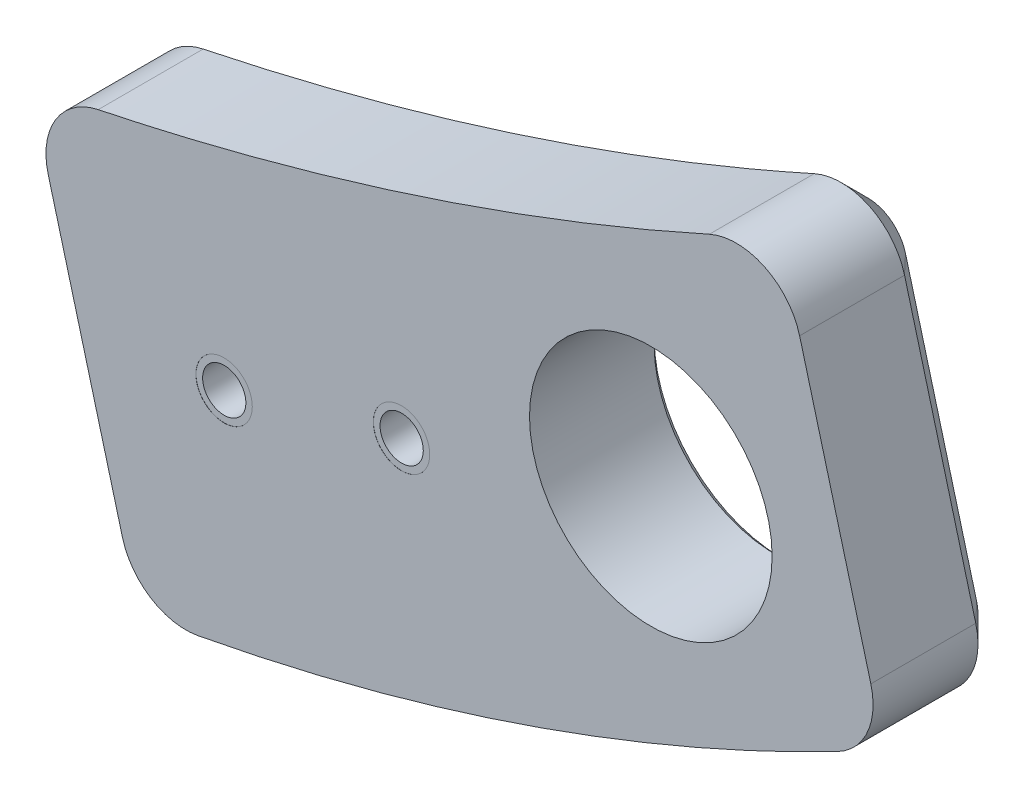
ISO-10303-21;
HEADER;
FILE_DESCRIPTION(('STEP AP214'),'2;1');
FILE_NAME('part.step','',(''),(''),'','','');
FILE_SCHEMA(('AUTOMOTIVE_DESIGN { 1 0 10303 214 1 1 1 1 }'));
ENDSEC;
DATA;
#1=APPLICATION_CONTEXT('core data for automotive mechanical design processes');
#2=APPLICATION_PROTOCOL_DEFINITION('international standard','automotive_design',2000,#1);
#3=PRODUCT_CONTEXT('',#1,'mechanical');
#4=PRODUCT('Part','Part','',(#3));
#5=PRODUCT_RELATED_PRODUCT_CATEGORY('part','',(#4));
#6=PRODUCT_DEFINITION_FORMATION('','',#4);
#7=PRODUCT_DEFINITION_CONTEXT('part definition',#1,'design');
#8=PRODUCT_DEFINITION('design','',#6,#7);
#9=PRODUCT_DEFINITION_SHAPE('','',#8);
#10=(LENGTH_UNIT() NAMED_UNIT(*) SI_UNIT(.MILLI.,.METRE.));
#11=(NAMED_UNIT(*) PLANE_ANGLE_UNIT() SI_UNIT($,.RADIAN.));
#12=(NAMED_UNIT(*) SI_UNIT($,.STERADIAN.) SOLID_ANGLE_UNIT());
#13=UNCERTAINTY_MEASURE_WITH_UNIT(LENGTH_MEASURE(1.E-05),#10,'distance_accuracy_value','');
#14=(GEOMETRIC_REPRESENTATION_CONTEXT(3) GLOBAL_UNCERTAINTY_ASSIGNED_CONTEXT((#13)) GLOBAL_UNIT_ASSIGNED_CONTEXT((#10,
#11,#12)) REPRESENTATION_CONTEXT('',''));
#15=CARTESIAN_POINT('',(0.,0.,0.));
#16=DIRECTION('',(0.,0.,1.));
#17=DIRECTION('',(1.,0.,0.));
#18=AXIS2_PLACEMENT_3D('',#15,#16,#17);
#19=CARTESIAN_POINT('',(58.91880680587,-209.017886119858,-10.));
#20=DIRECTION('',(0.,0.,-1.));
#21=DIRECTION('',(1.,0.,0.));
#22=AXIS2_PLACEMENT_3D('',#19,#20,#21);
#23=CYLINDRICAL_SURFACE('',#22,2.15);
#24=CARTESIAN_POINT('',(58.91880680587,-209.017886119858,0.));
#25=DIRECTION('',(0.,0.,1.));
#26=DIRECTION('',(1.,0.,0.));
#27=AXIS2_PLACEMENT_3D('',#24,#25,#26);
#28=CIRCLE('',#27,2.15);
#29=CARTESIAN_POINT('',(61.06880680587,-209.017886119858,0.));
#30=VERTEX_POINT('',#29);
#31=EDGE_CURVE('E157',#30,#30,#28,.T.);
#32=ORIENTED_EDGE('',*,*,#31,.T.);
#33=EDGE_LOOP('',(#32));
#34=FACE_BOUND('',#33,.T.);
#35=CARTESIAN_POINT('',(58.91880680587,-209.017886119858,-0.00999999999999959));
#36=DIRECTION('',(0.,0.,-1.));
#37=DIRECTION('',(-1.,0.,0.));
#38=AXIS2_PLACEMENT_3D('',#35,#36,#37);
#39=CIRCLE('',#38,2.15);
#40=CARTESIAN_POINT('',(56.76880680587,-209.017886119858,-0.00999999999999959));
#41=VERTEX_POINT('',#40);
#42=EDGE_CURVE('E12',#41,#41,#39,.F.);
#43=ORIENTED_EDGE('',*,*,#42,.F.);
#44=EDGE_LOOP('',(#43));
#45=FACE_BOUND('',#44,.T.);
#46=ADVANCED_FACE('F36',(#34,#45),#23,.F.);
#47=CARTESIAN_POINT('',(72.4467445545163,-205.413042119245,-10.));
#48=DIRECTION('',(0.,0.,-1.));
#49=DIRECTION('',(1.,0.,0.));
#50=AXIS2_PLACEMENT_3D('',#47,#48,#49);
#51=CYLINDRICAL_SURFACE('',#50,2.15);
#52=CARTESIAN_POINT('',(72.4467445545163,-205.413042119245,0.));
#53=DIRECTION('',(0.,0.,1.));
#54=DIRECTION('',(1.,0.,0.));
#55=AXIS2_PLACEMENT_3D('',#52,#53,#54);
#56=CIRCLE('',#55,2.15);
#57=CARTESIAN_POINT('',(74.5967445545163,-205.413042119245,0.));
#58=VERTEX_POINT('',#57);
#59=EDGE_CURVE('E152',#58,#58,#56,.T.);
#60=ORIENTED_EDGE('',*,*,#59,.T.);
#61=EDGE_LOOP('',(#60));
#62=FACE_BOUND('',#61,.T.);
#63=CARTESIAN_POINT('',(72.4467445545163,-205.413042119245,-0.00999999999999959));
#64=DIRECTION('',(0.,0.,-1.));
#65=DIRECTION('',(-1.,0.,0.));
#66=AXIS2_PLACEMENT_3D('',#63,#64,#65);
#67=CIRCLE('',#66,2.15);
#68=CARTESIAN_POINT('',(70.2967445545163,-205.413042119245,-0.00999999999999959));
#69=VERTEX_POINT('',#68);
#70=EDGE_CURVE('E44',#69,#69,#67,.F.);
#71=ORIENTED_EDGE('',*,*,#70,.F.);
#72=EDGE_LOOP('',(#71));
#73=FACE_BOUND('',#72,.T.);
#74=ADVANCED_FACE('F169',(#62,#73),#51,.F.);
#75=CARTESIAN_POINT('',(45.7938400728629,-131.897870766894,-4.));
#76=DIRECTION('',(0.,0.,1.));
#77=DIRECTION('',(-0.965925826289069,-0.25881904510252,0.));
#78=AXIS2_PLACEMENT_3D('',#75,#76,#77);
#79=ELLIPSE('',#78,130.28,94.5);
#80=DIRECTION('',(0.,0.,1.));
#81=VECTOR('',#80,1.);
#82=SURFACE_OF_LINEAR_EXTRUSION('',#79,#81);
#83=DIRECTION('',(0.,0.,1.));
#84=VECTOR('',#83,1.);
#85=CARTESIAN_POINT('',(105.704191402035,-209.472004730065,0.));
#86=LINE('',#85,#84);
#87=CARTESIAN_POINT('',(105.704191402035,-209.472004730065,0.));
#88=VERTEX_POINT('',#87);
#89=CARTESIAN_POINT('',(105.704191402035,-209.472004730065,-7.99999999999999));
#90=VERTEX_POINT('',#89);
#91=EDGE_CURVE('E474',#88,#90,#86,.F.);
#92=ORIENTED_EDGE('',*,*,#91,.F.);
#93=CARTESIAN_POINT('',(45.7938400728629,-131.897870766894,0.));
#94=DIRECTION('',(0.,0.,1.));
#95=DIRECTION('',(-0.965925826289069,-0.25881904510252,0.));
#96=AXIS2_PLACEMENT_3D('',#93,#94,#95);
#97=ELLIPSE('',#96,130.28,94.5);
#98=CARTESIAN_POINT('',(56.9191718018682,-226.210883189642,0.));
#99=VERTEX_POINT('',#98);
#100=EDGE_CURVE('E491',#99,#88,#97,.T.);
#101=ORIENTED_EDGE('',*,*,#100,.F.);
#102=DIRECTION('',(0.,0.,1.));
#103=VECTOR('',#102,1.);
#104=CARTESIAN_POINT('',(56.9191718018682,-226.210883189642,-4.));
#105=LINE('',#104,#103);
#106=CARTESIAN_POINT('',(56.9191718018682,-226.210883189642,-7.99999999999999));
#107=VERTEX_POINT('',#106);
#108=EDGE_CURVE('E484',#107,#99,#105,.T.);
#109=ORIENTED_EDGE('',*,*,#108,.F.);
#110=CARTESIAN_POINT('',(105.704191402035,-209.472004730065,-7.99999999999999));
#111=CARTESIAN_POINT('',(90.2570401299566,-217.453363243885,-7.99999999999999));
#112=CARTESIAN_POINT('',(73.9873508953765,-222.986543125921,-7.99999999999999));
#113=CARTESIAN_POINT('',(56.9191718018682,-226.210883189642,-7.99999999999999));
#114=B_SPLINE_CURVE_WITH_KNOTS('',3,(#110,#111,#112,#113),.UNSPECIFIED.,.F.,.F.,(4,4),(0.,
0.0509933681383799),.UNSPECIFIED.);
#115=EDGE_CURVE('E190',#90,#107,#114,.T.);
#116=ORIENTED_EDGE('',*,*,#115,.F.);
#117=EDGE_LOOP('',(#92,#101,#109,#116));
#118=FACE_BOUND('',#117,.T.);
#119=ADVANCED_FACE('F163',(#118),#82,.T.);
#120=CARTESIAN_POINT('',(45.7938400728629,-131.897870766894,-4.));
#121=DIRECTION('',(0.,0.,-1.));
#122=DIRECTION('',(0.965925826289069,0.25881904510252,0.));
#123=AXIS2_PLACEMENT_3D('',#120,#121,#122);
#124=ELLIPSE('',#123,120.,62.5);
#125=DIRECTION('',(0.,0.,1.));
#126=VECTOR('',#125,1.);
#127=SURFACE_OF_LINEAR_EXTRUSION('',#124,#126);
#128=DIRECTION('',(0.,0.,1.));
#129=VECTOR('',#128,1.);
#130=CARTESIAN_POINT('',(49.3187012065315,-195.277391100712,0.));
#131=LINE('',#130,#129);
#132=CARTESIAN_POINT('',(49.3187012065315,-195.277391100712,0.));
#133=VERTEX_POINT('',#132);
#134=CARTESIAN_POINT('',(49.3187012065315,-195.277391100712,-7.99999999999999));
#135=VERTEX_POINT('',#134);
#136=EDGE_CURVE('E412',#133,#135,#131,.F.);
#137=ORIENTED_EDGE('',*,*,#136,.F.);
#138=CARTESIAN_POINT('',(45.7938400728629,-131.897870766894,0.));
#139=DIRECTION('',(0.,0.,-1.));
#140=DIRECTION('',(0.965925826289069,0.25881904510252,0.));
#141=AXIS2_PLACEMENT_3D('',#138,#139,#140);
#142=ELLIPSE('',#141,120.,62.5);
#143=CARTESIAN_POINT('',(95.916568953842,-180.206914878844,0.));
#144=VERTEX_POINT('',#143);
#145=EDGE_CURVE('E461',#144,#133,#142,.T.);
#146=ORIENTED_EDGE('',*,*,#145,.F.);
#147=DIRECTION('',(0.,0.,1.));
#148=VECTOR('',#147,1.);
#149=CARTESIAN_POINT('',(95.916568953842,-180.206914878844,-4.));
#150=LINE('',#149,#148);
#151=CARTESIAN_POINT('',(95.916568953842,-180.206914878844,-7.99999999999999));
#152=VERTEX_POINT('',#151);
#153=EDGE_CURVE('E419',#152,#144,#150,.T.);
#154=ORIENTED_EDGE('',*,*,#153,.F.);
#155=CARTESIAN_POINT('',(49.3187012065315,-195.277391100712,-7.99999999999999));
#156=CARTESIAN_POINT('',(65.3912848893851,-191.917628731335,-7.99999999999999));
#157=CARTESIAN_POINT('',(80.948310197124,-186.939678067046,-7.99999999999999));
#158=CARTESIAN_POINT('',(95.916568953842,-180.206914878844,-7.99999999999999));
#159=B_SPLINE_CURVE_WITH_KNOTS('',3,(#155,#156,#157,#158),.UNSPECIFIED.,.F.,.F.,(4,4),(0.,
0.049410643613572),.UNSPECIFIED.);
#160=EDGE_CURVE('E448',#135,#152,#159,.T.);
#161=ORIENTED_EDGE('',*,*,#160,.F.);
#162=EDGE_LOOP('',(#137,#146,#154,#161));
#163=FACE_BOUND('',#162,.T.);
#164=ADVANCED_FACE('F168',(#163),#127,.T.);
#165=CARTESIAN_POINT('',(-14.239497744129,-121.423692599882,0.));
#166=DIRECTION('',(0.,0.,-1.));
#167=DIRECTION('',(1.,0.,0.));
#168=AXIS2_PLACEMENT_3D('',#165,#166,#167);
#169=PLANE('',#168);
#170=ORIENTED_EDGE('',*,*,#59,.F.);
#171=EDGE_LOOP('',(#170));
#172=FACE_BOUND('',#171,.T.);
#173=ORIENTED_EDGE('',*,*,#31,.F.);
#174=EDGE_LOOP('',(#173));
#175=FACE_BOUND('',#174,.T.);
#176=CARTESIAN_POINT('',(91.4554272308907,-199.08029427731,0.));
#177=DIRECTION('',(0.,0.,1.));
#178=DIRECTION('',(1.,0.,0.));
#179=AXIS2_PLACEMENT_3D('',#176,#177,#178);
#180=CIRCLE('',#179,9.24999999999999);
#181=CARTESIAN_POINT('',(100.705427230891,-199.08029427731,0.));
#182=VERTEX_POINT('',#181);
#183=EDGE_CURVE('E153',#182,#182,#180,.T.);
#184=ORIENTED_EDGE('',*,*,#183,.F.);
#185=EDGE_LOOP('',(#184));
#186=FACE_BOUND('',#185,.T.);
#187=ORIENTED_EDGE('',*,*,#100,.T.);
#188=CARTESIAN_POINT('',(103.403192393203,-205.032927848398,0.));
#189=DIRECTION('',(0.,0.,1.));
#190=DIRECTION('',(1.,0.,0.));
#191=AXIS2_PLACEMENT_3D('',#188,#189,#190);
#192=CIRCLE('',#191,5.);
#193=CARTESIAN_POINT('',(108.232821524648,-203.738832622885,0.));
#194=VERTEX_POINT('',#193);
#195=EDGE_CURVE('E472',#194,#88,#192,.F.);
#196=ORIENTED_EDGE('',*,*,#195,.F.);
#197=DIRECTION('',(-0.25881904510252,0.965925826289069,0.));
#198=VECTOR('',#197,1.);
#199=CARTESIAN_POINT('',(101.257172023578,-177.705354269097,0.));
#200=LINE('',#199,#198);
#201=CARTESIAN_POINT('',(102.801977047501,-183.470645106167,0.));
#202=VERTEX_POINT('',#201);
#203=EDGE_CURVE('E465',#194,#202,#200,.T.);
#204=ORIENTED_EDGE('',*,*,#203,.T.);
#205=CARTESIAN_POINT('',(97.9723479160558,-184.76474033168,0.));
#206=DIRECTION('',(0.,0.,1.));
#207=DIRECTION('',(1.,0.,0.));
#208=AXIS2_PLACEMENT_3D('',#205,#206,#207);
#209=CIRCLE('',#208,5.);
#210=EDGE_CURVE('E459',#144,#202,#209,.F.);
#211=ORIENTED_EDGE('',*,*,#210,.F.);
#212=ORIENTED_EDGE('',*,*,#145,.T.);
#213=CARTESIAN_POINT('',(50.3370590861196,-200.172587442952,0.));
#214=DIRECTION('',(0.,0.,1.));
#215=DIRECTION('',(1.,0.,0.));
#216=AXIS2_PLACEMENT_3D('',#213,#214,#215);
#217=CIRCLE('',#216,5.);
#218=CARTESIAN_POINT('',(45.5074299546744,-201.466682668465,0.));
#219=VERTEX_POINT('',#218);
#220=EDGE_CURVE('E487',#219,#133,#217,.F.);
#221=ORIENTED_EDGE('',*,*,#220,.F.);
#222=DIRECTION('',(0.258819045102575,-0.965925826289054,0.));
#223=VECTOR('',#222,1.);
#224=CARTESIAN_POINT('',(44.1217640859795,-196.295307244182,0.));
#225=LINE('',#224,#223);
#226=CARTESIAN_POINT('',(51.1675965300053,-222.590711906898,0.));
#227=VERTEX_POINT('',#226);
#228=EDGE_CURVE('E506',#219,#227,#225,.T.);
#229=ORIENTED_EDGE('',*,*,#228,.T.);
#230=CARTESIAN_POINT('',(55.9972256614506,-221.296616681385,0.));
#231=DIRECTION('',(0.,0.,1.));
#232=DIRECTION('',(1.,0.,0.));
#233=AXIS2_PLACEMENT_3D('',#230,#231,#232);
#234=CIRCLE('',#233,5.);
#235=EDGE_CURVE('E418',#99,#227,#234,.F.);
#236=ORIENTED_EDGE('',*,*,#235,.F.);
#237=EDGE_LOOP('',(#187,#196,#204,#211,#212,#221,#229,#236));
#238=FACE_BOUND('',#237,.T.);
#239=ADVANCED_FACE('F507',(#172,#175,#186,#238),#169,.F.);
#240=CARTESIAN_POINT('',(101.257172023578,-177.705354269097,-4.));
#241=DIRECTION('',(-0.965925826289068,-0.25881904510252,0.));
#242=DIRECTION('',(0.25881904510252,-0.965925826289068,0.));
#243=AXIS2_PLACEMENT_3D('',#240,#241,#242);
#244=PLANE('',#243);
#245=DIRECTION('',(0.,0.,1.));
#246=VECTOR('',#245,1.);
#247=CARTESIAN_POINT('',(102.801977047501,-183.470645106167,-4.));
#248=LINE('',#247,#246);
#249=CARTESIAN_POINT('',(102.801977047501,-183.470645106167,-7.99999999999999));
#250=VERTEX_POINT('',#249);
#251=EDGE_CURVE('E453',#202,#250,#248,.F.);
#252=ORIENTED_EDGE('',*,*,#251,.F.);
#253=ORIENTED_EDGE('',*,*,#203,.F.);
#254=DIRECTION('',(0.,0.,1.));
#255=VECTOR('',#254,1.);
#256=CARTESIAN_POINT('',(108.232821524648,-203.738832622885,-4.));
#257=LINE('',#256,#255);
#258=CARTESIAN_POINT('',(108.232821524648,-203.738832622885,-7.99999999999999));
#259=VERTEX_POINT('',#258);
#260=EDGE_CURVE('E455',#259,#194,#257,.T.);
#261=ORIENTED_EDGE('',*,*,#260,.F.);
#262=DIRECTION('',(0.25881904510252,-0.965925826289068,0.));
#263=VECTOR('',#262,1.);
#264=CARTESIAN_POINT('',(108.232821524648,-203.738832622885,-7.99999999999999));
#265=LINE('',#264,#263);
#266=EDGE_CURVE('E447',#250,#259,#265,.T.);
#267=ORIENTED_EDGE('',*,*,#266,.F.);
#268=EDGE_LOOP('',(#252,#253,#261,#267));
#269=FACE_BOUND('',#268,.T.);
#270=ADVANCED_FACE('F171',(#269),#244,.F.);
#271=CARTESIAN_POINT('',(103.403192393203,-205.032927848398,-2.));
#272=DIRECTION('',(0.,0.,1.));
#273=DIRECTION('',(-1.,0.,0.));
#274=AXIS2_PLACEMENT_3D('',#271,#272,#273);
#275=CYLINDRICAL_SURFACE('',#274,5.);
#276=ORIENTED_EDGE('',*,*,#260,.T.);
#277=ORIENTED_EDGE('',*,*,#195,.T.);
#278=ORIENTED_EDGE('',*,*,#91,.T.);
#279=CARTESIAN_POINT('',(103.403192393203,-205.032927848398,-7.99999999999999));
#280=DIRECTION('',(0.,0.,1.));
#281=DIRECTION('',(1.,0.,0.));
#282=AXIS2_PLACEMENT_3D('',#279,#280,#281);
#283=CIRCLE('',#282,5.);
#284=EDGE_CURVE('E456',#259,#90,#283,.F.);
#285=ORIENTED_EDGE('',*,*,#284,.F.);
#286=EDGE_LOOP('',(#276,#277,#278,#285));
#287=FACE_BOUND('',#286,.T.);
#288=ADVANCED_FACE('F173',(#287),#275,.T.);
#289=CARTESIAN_POINT('',(97.9723479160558,-184.76474033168,-2.));
#290=DIRECTION('',(0.,0.,1.));
#291=DIRECTION('',(-1.,0.,0.));
#292=AXIS2_PLACEMENT_3D('',#289,#290,#291);
#293=CYLINDRICAL_SURFACE('',#292,5.);
#294=ORIENTED_EDGE('',*,*,#153,.T.);
#295=ORIENTED_EDGE('',*,*,#210,.T.);
#296=ORIENTED_EDGE('',*,*,#251,.T.);
#297=CARTESIAN_POINT('',(97.9723479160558,-184.76474033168,-7.99999999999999));
#298=DIRECTION('',(0.,0.,1.));
#299=DIRECTION('',(1.,0.,0.));
#300=AXIS2_PLACEMENT_3D('',#297,#298,#299);
#301=CIRCLE('',#300,5.);
#302=EDGE_CURVE('E442',#152,#250,#301,.F.);
#303=ORIENTED_EDGE('',*,*,#302,.F.);
#304=EDGE_LOOP('',(#294,#295,#296,#303));
#305=FACE_BOUND('',#304,.T.);
#306=ADVANCED_FACE('F458',(#305),#293,.T.);
#307=CARTESIAN_POINT('',(44.1217640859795,-196.295307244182,0.));
#308=DIRECTION('',(-0.965925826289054,-0.258819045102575,0.));
#309=DIRECTION('',(0.258819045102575,-0.965925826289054,0.));
#310=AXIS2_PLACEMENT_3D('',#307,#308,#309);
#311=PLANE('',#310);
#312=DIRECTION('',(0.,0.,-1.));
#313=VECTOR('',#312,1.);
#314=CARTESIAN_POINT('',(51.1675965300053,-222.590711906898,-4.));
#315=LINE('',#314,#313);
#316=CARTESIAN_POINT('',(51.1675965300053,-222.590711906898,-7.99999999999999));
#317=VERTEX_POINT('',#316);
#318=EDGE_CURVE('E488',#227,#317,#315,.T.);
#319=ORIENTED_EDGE('',*,*,#318,.F.);
#320=ORIENTED_EDGE('',*,*,#228,.F.);
#321=DIRECTION('',(0.,0.,-1.));
#322=VECTOR('',#321,1.);
#323=CARTESIAN_POINT('',(45.5074299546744,-201.466682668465,0.));
#324=LINE('',#323,#322);
#325=CARTESIAN_POINT('',(45.5074299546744,-201.466682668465,-7.99999999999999));
#326=VERTEX_POINT('',#325);
#327=EDGE_CURVE('E515',#326,#219,#324,.F.);
#328=ORIENTED_EDGE('',*,*,#327,.F.);
#329=DIRECTION('',(-0.258819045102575,0.965925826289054,0.));
#330=VECTOR('',#329,1.);
#331=CARTESIAN_POINT('',(44.1217640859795,-196.295307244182,-7.99999999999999));
#332=LINE('',#331,#330);
#333=EDGE_CURVE('E189',#317,#326,#332,.T.);
#334=ORIENTED_EDGE('',*,*,#333,.F.);
#335=EDGE_LOOP('',(#319,#320,#328,#334));
#336=FACE_BOUND('',#335,.T.);
#337=ADVANCED_FACE('F383',(#336),#311,.T.);
#338=CARTESIAN_POINT('',(55.9972256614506,-221.296616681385,-2.));
#339=DIRECTION('',(0.,0.,1.));
#340=DIRECTION('',(-1.,0.,0.));
#341=AXIS2_PLACEMENT_3D('',#338,#339,#340);
#342=CYLINDRICAL_SURFACE('',#341,5.);
#343=ORIENTED_EDGE('',*,*,#108,.T.);
#344=ORIENTED_EDGE('',*,*,#235,.T.);
#345=ORIENTED_EDGE('',*,*,#318,.T.);
#346=CARTESIAN_POINT('',(55.9972256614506,-221.296616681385,-7.99999999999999));
#347=DIRECTION('',(0.,0.,1.));
#348=DIRECTION('',(1.,0.,0.));
#349=AXIS2_PLACEMENT_3D('',#346,#347,#348);
#350=CIRCLE('',#349,5.);
#351=EDGE_CURVE('E182',#107,#317,#350,.F.);
#352=ORIENTED_EDGE('',*,*,#351,.F.);
#353=EDGE_LOOP('',(#343,#344,#345,#352));
#354=FACE_BOUND('',#353,.T.);
#355=ADVANCED_FACE('F499',(#354),#342,.T.);
#356=CARTESIAN_POINT('',(50.3370590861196,-200.172587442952,-2.));
#357=DIRECTION('',(0.,0.,1.));
#358=DIRECTION('',(-1.,0.,0.));
#359=AXIS2_PLACEMENT_3D('',#356,#357,#358);
#360=CYLINDRICAL_SURFACE('',#359,5.);
#361=ORIENTED_EDGE('',*,*,#327,.T.);
#362=ORIENTED_EDGE('',*,*,#220,.T.);
#363=ORIENTED_EDGE('',*,*,#136,.T.);
#364=CARTESIAN_POINT('',(50.3370590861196,-200.172587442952,-7.99999999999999));
#365=DIRECTION('',(0.,0.,1.));
#366=DIRECTION('',(1.,0.,0.));
#367=AXIS2_PLACEMENT_3D('',#364,#365,#366);
#368=CIRCLE('',#367,5.);
#369=EDGE_CURVE('E194',#326,#135,#368,.F.);
#370=ORIENTED_EDGE('',*,*,#369,.F.);
#371=EDGE_LOOP('',(#361,#362,#363,#370));
#372=FACE_BOUND('',#371,.T.);
#373=ADVANCED_FACE('F230',(#372),#360,.T.);
#374=CARTESIAN_POINT('',(45.7938400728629,-131.897870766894,-10.));
#375=DIRECTION('',(0.,0.,-1.));
#376=DIRECTION('',(1.,0.,0.));
#377=AXIS2_PLACEMENT_3D('',#374,#375,#376);
#378=PLANE('',#377);
#379=CARTESIAN_POINT('',(91.4554272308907,-199.08029427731,-10.));
#380=DIRECTION('',(0.,0.,1.));
#381=DIRECTION('',(1.,0.,0.));
#382=AXIS2_PLACEMENT_3D('',#379,#380,#381);
#383=CIRCLE('',#382,9.75000000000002);
#384=CARTESIAN_POINT('',(101.205427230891,-199.08029427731,-10.));
#385=VERTEX_POINT('',#384);
#386=EDGE_CURVE('E354',#385,#385,#383,.F.);
#387=ORIENTED_EDGE('',*,*,#386,.F.);
#388=EDGE_LOOP('',(#387));
#389=FACE_BOUND('',#388,.T.);
#390=CARTESIAN_POINT('',(97.9723479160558,-184.76474033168,-10.));
#391=DIRECTION('',(0.,0.,1.));
#392=DIRECTION('',(1.,0.,0.));
#393=AXIS2_PLACEMENT_3D('',#390,#391,#392);
#394=CIRCLE('',#393,3.00000000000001);
#395=CARTESIAN_POINT('',(100.870125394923,-183.988283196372,-10.));
#396=VERTEX_POINT('',#395);
#397=CARTESIAN_POINT('',(96.7388805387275,-182.030045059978,-10.));
#398=VERTEX_POINT('',#397);
#399=EDGE_CURVE('E398',#396,#398,#394,.T.);
#400=ORIENTED_EDGE('',*,*,#399,.F.);
#401=DIRECTION('',(-0.25881904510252,0.965925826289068,0.));
#402=VECTOR('',#401,1.);
#403=CARTESIAN_POINT('',(100.870125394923,-183.988283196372,-10.));
#404=LINE('',#403,#402);
#405=CARTESIAN_POINT('',(106.30096987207,-204.25647071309,-10.));
#406=VERTEX_POINT('',#405);
#407=EDGE_CURVE('E406',#406,#396,#404,.T.);
#408=ORIENTED_EDGE('',*,*,#407,.F.);
#409=CARTESIAN_POINT('',(103.403192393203,-205.032927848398,-10.));
#410=DIRECTION('',(0.,0.,1.));
#411=DIRECTION('',(1.,0.,0.));
#412=AXIS2_PLACEMENT_3D('',#409,#410,#411);
#413=CIRCLE('',#412,2.99999999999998);
#414=CARTESIAN_POINT('',(104.783791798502,-207.696373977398,-10.));
#415=VERTEX_POINT('',#414);
#416=EDGE_CURVE('E433',#415,#406,#413,.T.);
#417=ORIENTED_EDGE('',*,*,#416,.F.);
#418=CARTESIAN_POINT('',(56.5503933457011,-224.245176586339,-10.));
#419=CARTESIAN_POINT('',(73.4270835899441,-221.057368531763,-10.));
#420=CARTESIAN_POINT('',(89.519480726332,-215.583647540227,-9.99999999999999));
#421=CARTESIAN_POINT('',(104.783791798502,-207.696373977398,-10.));
#422=B_SPLINE_CURVE_WITH_KNOTS('',3,(#418,#419,#420,#421),.UNSPECIFIED.,.F.,.F.,(4,4),(0.,
0.0509933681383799),.UNSPECIFIED.);
#423=CARTESIAN_POINT('',(56.5503933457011,-224.245176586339,-10.));
#424=VERTEX_POINT('',#423);
#425=EDGE_CURVE('E342',#424,#415,#422,.T.);
#426=ORIENTED_EDGE('',*,*,#425,.F.);
#427=CARTESIAN_POINT('',(55.9972256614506,-221.296616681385,-10.));
#428=DIRECTION('',(0.,0.,1.));
#429=DIRECTION('',(1.,0.,0.));
#430=AXIS2_PLACEMENT_3D('',#427,#428,#429);
#431=CIRCLE('',#430,2.99999999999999);
#432=CARTESIAN_POINT('',(53.0994481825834,-222.073073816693,-10.));
#433=VERTEX_POINT('',#432);
#434=EDGE_CURVE('E426',#433,#424,#431,.T.);
#435=ORIENTED_EDGE('',*,*,#434,.F.);
#436=DIRECTION('',(0.258819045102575,-0.965925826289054,0.));
#437=VECTOR('',#436,1.);
#438=CARTESIAN_POINT('',(30.0662644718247,-136.112061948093,-10.));
#439=LINE('',#438,#437);
#440=CARTESIAN_POINT('',(47.4392816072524,-200.949044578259,-10.));
#441=VERTEX_POINT('',#440);
#442=EDGE_CURVE('E411',#441,#433,#439,.T.);
#443=ORIENTED_EDGE('',*,*,#442,.F.);
#444=CARTESIAN_POINT('',(50.3370590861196,-200.172587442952,-10.));
#445=DIRECTION('',(0.,0.,1.));
#446=DIRECTION('',(1.,0.,0.));
#447=AXIS2_PLACEMENT_3D('',#444,#445,#446);
#448=CIRCLE('',#447,3.);
#449=CARTESIAN_POINT('',(49.7260443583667,-197.235469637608,-10.));
#450=VERTEX_POINT('',#449);
#451=EDGE_CURVE('E409',#450,#441,#448,.T.);
#452=ORIENTED_EDGE('',*,*,#451,.F.);
#453=CARTESIAN_POINT('',(96.7388805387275,-182.030045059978,-10.));
#454=CARTESIAN_POINT('',(81.6269983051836,-188.827057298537,-10.));
#455=CARTESIAN_POINT('',(65.9399743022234,-193.845819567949,-9.99999999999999));
#456=CARTESIAN_POINT('',(49.7260443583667,-197.235469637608,-10.));
#457=B_SPLINE_CURVE_WITH_KNOTS('',3,(#453,#454,#455,#456),.UNSPECIFIED.,.F.,.F.,(4,4),(0.,
0.049410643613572),.UNSPECIFIED.);
#458=EDGE_CURVE('E405',#398,#450,#457,.T.);
#459=ORIENTED_EDGE('',*,*,#458,.F.);
#460=EDGE_LOOP('',(#400,#408,#417,#426,#435,#443,#452,#459));
#461=FACE_BOUND('',#460,.T.);
#462=ADVANCED_FACE('F317',(#389,#461),#378,.T.);
#463=CARTESIAN_POINT('',(56.5503933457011,-224.245176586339,-10.));
#464=CARTESIAN_POINT('',(73.4270835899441,-221.057368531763,-10.));
#465=CARTESIAN_POINT('',(89.519480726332,-215.583647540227,-9.99999999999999));
#466=CARTESIAN_POINT('',(104.783791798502,-207.696373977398,-10.));
#467=CARTESIAN_POINT('',(56.9191718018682,-226.210883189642,-7.99999999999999));
#468=CARTESIAN_POINT('',(73.9873508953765,-222.986543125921,-7.99999999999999));
#469=CARTESIAN_POINT('',(90.2570401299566,-217.453363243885,-7.99999999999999));
#470=CARTESIAN_POINT('',(105.704191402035,-209.472004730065,-7.99999999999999));
#471=B_SPLINE_SURFACE_WITH_KNOTS('',1,3,((#463,#464,#465,#466),(#467,#468,#469,#470)),
.UNSPECIFIED.,.F.,.F.,.F.,(2,2),(4,4),(0.,1.),(0.,0.0509933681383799),.UNSPECIFIED.);
#472=CARTESIAN_POINT('',(56.9191718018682,-226.210883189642,-7.99999999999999));
#473=CARTESIAN_POINT('',(56.5503933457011,-224.245176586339,-10.));
#474=B_SPLINE_CURVE_WITH_KNOTS('',1,(#472,#473),.UNSPECIFIED.,.F.,.F.,(2,2),(0.,1.),.UNSPECIFIED.);
#475=EDGE_CURVE('E206',#107,#424,#474,.T.);
#476=CARTESIAN_POINT('',(104.783791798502,-207.696373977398,-10.));
#477=CARTESIAN_POINT('',(105.704191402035,-209.472004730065,-7.99999999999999));
#478=B_SPLINE_CURVE_WITH_KNOTS('',1,(#476,#477),.UNSPECIFIED.,.F.,.F.,(2,2),(0.,1.),.UNSPECIFIED.);
#479=EDGE_CURVE('E510',#415,#90,#478,.T.);
#480=ORIENTED_EDGE('',*,*,#475,.T.);
#481=ORIENTED_EDGE('',*,*,#425,.T.);
#482=ORIENTED_EDGE('',*,*,#479,.T.);
#483=ORIENTED_EDGE('',*,*,#115,.T.);
#484=EDGE_LOOP('',(#480,#481,#482,#483));
#485=FACE_BOUND('',#484,.T.);
#486=ADVANCED_FACE('F307',(#485),#471,.F.);
#487=CARTESIAN_POINT('',(103.403192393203,-205.032927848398,-10.));
#488=DIRECTION('',(0.,0.,1.));
#489=DIRECTION('',(-1.,0.,0.));
#490=AXIS2_PLACEMENT_3D('',#487,#488,#489);
#491=CONICAL_SURFACE('',#490,2.99999999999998,0.78539816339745);
#492=ORIENTED_EDGE('',*,*,#479,.F.);
#493=ORIENTED_EDGE('',*,*,#416,.T.);
#494=DIRECTION('',(0.683012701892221,0.183012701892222,0.707106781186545));
#495=VECTOR('',#494,1.);
#496=CARTESIAN_POINT('',(106.30096987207,-204.25647071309,-10.));
#497=LINE('',#496,#495);
#498=EDGE_CURVE('E204',#406,#259,#497,.T.);
#499=ORIENTED_EDGE('',*,*,#498,.T.);
#500=ORIENTED_EDGE('',*,*,#284,.T.);
#501=EDGE_LOOP('',(#492,#493,#499,#500));
#502=FACE_BOUND('',#501,.T.);
#503=ADVANCED_FACE('F285',(#502),#491,.T.);
#504=CARTESIAN_POINT('',(55.9972256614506,-221.296616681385,-10.));
#505=DIRECTION('',(0.,0.,1.));
#506=DIRECTION('',(-1.,0.,0.));
#507=AXIS2_PLACEMENT_3D('',#504,#505,#506);
#508=CONICAL_SURFACE('',#507,3.,0.785398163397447);
#509=ORIENTED_EDGE('',*,*,#475,.F.);
#510=ORIENTED_EDGE('',*,*,#351,.T.);
#511=DIRECTION('',(0.683012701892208,0.183012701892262,-0.707106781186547));
#512=VECTOR('',#511,1.);
#513=CARTESIAN_POINT('',(51.1675965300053,-222.590711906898,-7.99999999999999));
#514=LINE('',#513,#512);
#515=EDGE_CURVE('E59',#317,#433,#514,.T.);
#516=ORIENTED_EDGE('',*,*,#515,.T.);
#517=ORIENTED_EDGE('',*,*,#434,.T.);
#518=EDGE_LOOP('',(#509,#510,#516,#517));
#519=FACE_BOUND('',#518,.T.);
#520=ADVANCED_FACE('F280',(#519),#508,.T.);
#521=CARTESIAN_POINT('',(84.1581107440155,-121.61819542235,-10.));
#522=DIRECTION('',(0.683012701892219,0.183012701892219,-0.707106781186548));
#523=DIRECTION('',(0.719254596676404,0.,0.694746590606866));
#524=AXIS2_PLACEMENT_3D('',#521,#522,#523);
#525=PLANE('',#524);
#526=ORIENTED_EDGE('',*,*,#498,.F.);
#527=ORIENTED_EDGE('',*,*,#407,.T.);
#528=DIRECTION('',(0.683012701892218,0.183012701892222,0.707106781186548));
#529=VECTOR('',#528,1.);
#530=CARTESIAN_POINT('',(100.870125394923,-183.988283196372,-10.));
#531=LINE('',#530,#529);
#532=EDGE_CURVE('E200',#396,#250,#531,.T.);
#533=ORIENTED_EDGE('',*,*,#532,.T.);
#534=ORIENTED_EDGE('',*,*,#266,.T.);
#535=EDGE_LOOP('',(#526,#527,#533,#534));
#536=FACE_BOUND('',#535,.T.);
#537=ADVANCED_FACE('F277',(#536),#525,.T.);
#538=CARTESIAN_POINT('',(30.0662644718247,-136.112061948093,-10.));
#539=DIRECTION('',(0.683012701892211,0.183012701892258,0.707106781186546));
#540=DIRECTION('',(-0.719254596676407,0.,0.694746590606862));
#541=AXIS2_PLACEMENT_3D('',#538,#539,#540);
#542=PLANE('',#541);
#543=ORIENTED_EDGE('',*,*,#515,.F.);
#544=ORIENTED_EDGE('',*,*,#333,.T.);
#545=DIRECTION('',(0.683012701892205,0.183012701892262,-0.70710678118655));
#546=VECTOR('',#545,1.);
#547=CARTESIAN_POINT('',(45.5074299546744,-201.466682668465,-7.99999999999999));
#548=LINE('',#547,#546);
#549=EDGE_CURVE('E51',#326,#441,#548,.T.);
#550=ORIENTED_EDGE('',*,*,#549,.T.);
#551=ORIENTED_EDGE('',*,*,#442,.T.);
#552=EDGE_LOOP('',(#543,#544,#550,#551));
#553=FACE_BOUND('',#552,.T.);
#554=ADVANCED_FACE('F274',(#553),#542,.F.);
#555=CARTESIAN_POINT('',(97.9723479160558,-184.76474033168,-10.));
#556=DIRECTION('',(0.,0.,1.));
#557=DIRECTION('',(-1.,0.,0.));
#558=AXIS2_PLACEMENT_3D('',#555,#556,#557);
#559=CONICAL_SURFACE('',#558,2.99999999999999,0.785398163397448);
#560=ORIENTED_EDGE('',*,*,#532,.F.);
#561=ORIENTED_EDGE('',*,*,#399,.T.);
#562=CARTESIAN_POINT('',(95.916568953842,-180.206914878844,-7.99999999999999));
#563=CARTESIAN_POINT('',(96.7388805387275,-182.030045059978,-10.));
#564=B_SPLINE_CURVE_WITH_KNOTS('',1,(#562,#563),.UNSPECIFIED.,.F.,.F.,(2,2),(0.,1.),.UNSPECIFIED.);
#565=EDGE_CURVE('E201',#398,#152,#564,.F.);
#566=ORIENTED_EDGE('',*,*,#565,.T.);
#567=ORIENTED_EDGE('',*,*,#302,.T.);
#568=EDGE_LOOP('',(#560,#561,#566,#567));
#569=FACE_BOUND('',#568,.T.);
#570=ADVANCED_FACE('F265',(#569),#559,.T.);
#571=CARTESIAN_POINT('',(50.3370590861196,-200.172587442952,-10.));
#572=DIRECTION('',(0.,0.,1.));
#573=DIRECTION('',(-1.,0.,0.));
#574=AXIS2_PLACEMENT_3D('',#571,#572,#573);
#575=CONICAL_SURFACE('',#574,3.,0.785398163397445);
#576=ORIENTED_EDGE('',*,*,#549,.F.);
#577=ORIENTED_EDGE('',*,*,#369,.T.);
#578=CARTESIAN_POINT('',(49.7260443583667,-197.235469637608,-10.));
#579=CARTESIAN_POINT('',(49.3187012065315,-195.277391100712,-7.99999999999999));
#580=B_SPLINE_CURVE_WITH_KNOTS('',1,(#578,#579),.UNSPECIFIED.,.F.,.F.,(2,2),(0.,1.),.UNSPECIFIED.);
#581=EDGE_CURVE('E156',#135,#450,#580,.F.);
#582=ORIENTED_EDGE('',*,*,#581,.T.);
#583=ORIENTED_EDGE('',*,*,#451,.T.);
#584=EDGE_LOOP('',(#576,#577,#582,#583));
#585=FACE_BOUND('',#584,.T.);
#586=ADVANCED_FACE('F229',(#585),#575,.T.);
#587=CARTESIAN_POINT('',(96.7388805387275,-182.030045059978,-10.));
#588=CARTESIAN_POINT('',(81.6269983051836,-188.827057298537,-10.));
#589=CARTESIAN_POINT('',(65.9399743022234,-193.845819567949,-9.99999999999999));
#590=CARTESIAN_POINT('',(49.7260443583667,-197.235469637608,-10.));
#591=CARTESIAN_POINT('',(95.916568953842,-180.206914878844,-7.99999999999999));
#592=CARTESIAN_POINT('',(80.948310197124,-186.939678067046,-7.99999999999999));
#593=CARTESIAN_POINT('',(65.3912848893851,-191.917628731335,-7.99999999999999));
#594=CARTESIAN_POINT('',(49.3187012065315,-195.277391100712,-7.99999999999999));
#595=B_SPLINE_SURFACE_WITH_KNOTS('',1,3,((#587,#588,#589,#590),(#591,#592,#593,#594)),
.UNSPECIFIED.,.F.,.F.,.F.,(2,2),(4,4),(0.,1.),(0.,0.049410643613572),.UNSPECIFIED.);
#596=ORIENTED_EDGE('',*,*,#565,.F.);
#597=ORIENTED_EDGE('',*,*,#458,.T.);
#598=ORIENTED_EDGE('',*,*,#581,.F.);
#599=ORIENTED_EDGE('',*,*,#160,.T.);
#600=EDGE_LOOP('',(#596,#597,#598,#599));
#601=FACE_BOUND('',#600,.T.);
#602=ADVANCED_FACE('F216',(#601),#595,.F.);
#603=CARTESIAN_POINT('',(91.4554272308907,-199.08029427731,-10.));
#604=DIRECTION('',(0.,0.,-1.));
#605=DIRECTION('',(1.,0.,0.));
#606=AXIS2_PLACEMENT_3D('',#603,#604,#605);
#607=CYLINDRICAL_SURFACE('',#606,9.24999999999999);
#608=CARTESIAN_POINT('',(91.4554272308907,-199.08029427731,-9.49999999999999));
#609=DIRECTION('',(0.,0.,1.));
#610=DIRECTION('',(1.,0.,0.));
#611=AXIS2_PLACEMENT_3D('',#608,#609,#610);
#612=CIRCLE('',#611,9.24999999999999);
#613=CARTESIAN_POINT('',(100.705427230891,-199.08029427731,-9.49999999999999));
#614=VERTEX_POINT('',#613);
#615=EDGE_CURVE('E196',#614,#614,#612,.T.);
#616=ORIENTED_EDGE('',*,*,#615,.F.);
#617=EDGE_LOOP('',(#616));
#618=FACE_BOUND('',#617,.T.);
#619=ORIENTED_EDGE('',*,*,#183,.T.);
#620=EDGE_LOOP('',(#619));
#621=FACE_BOUND('',#620,.T.);
#622=ADVANCED_FACE('F228',(#618,#621),#607,.F.);
#623=CARTESIAN_POINT('',(91.4554272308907,-199.08029427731,-9.49999999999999));
#624=DIRECTION('',(0.,0.,-1.));
#625=DIRECTION('',(1.,0.,0.));
#626=AXIS2_PLACEMENT_3D('',#623,#624,#625);
#627=CONICAL_SURFACE('',#626,9.24999999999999,0.785398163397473);
#628=ORIENTED_EDGE('',*,*,#386,.T.);
#629=EDGE_LOOP('',(#628));
#630=FACE_BOUND('',#629,.T.);
#631=ORIENTED_EDGE('',*,*,#615,.T.);
#632=EDGE_LOOP('',(#631));
#633=FACE_BOUND('',#632,.T.);
#634=ADVANCED_FACE('F38',(#630,#633),#627,.F.);
#635=CARTESIAN_POINT('',(-14.239497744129,-121.423692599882,-0.01));
#636=DIRECTION('',(0.,0.,-1.));
#637=DIRECTION('',(1.,0.,0.));
#638=AXIS2_PLACEMENT_3D('',#635,#636,#637);
#639=PLANE('',#638);
#640=CARTESIAN_POINT('',(72.4467445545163,-205.413042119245,-0.00999999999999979));
#641=DIRECTION('',(0.,0.,1.));
#642=DIRECTION('',(1.,0.,0.));
#643=AXIS2_PLACEMENT_3D('',#640,#641,#642);
#644=CIRCLE('',#643,1.65);
#645=CARTESIAN_POINT('',(74.0967445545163,-205.413042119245,-0.00999999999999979));
#646=VERTEX_POINT('',#645);
#647=EDGE_CURVE('E141',#646,#646,#644,.T.);
#648=ORIENTED_EDGE('',*,*,#647,.F.);
#649=EDGE_LOOP('',(#648));
#650=FACE_BOUND('',#649,.T.);
#651=ORIENTED_EDGE('',*,*,#70,.T.);
#652=EDGE_LOOP('',(#651));
#653=FACE_BOUND('',#652,.T.);
#654=ADVANCED_FACE('F363',(#650,#653),#639,.F.);
#655=CARTESIAN_POINT('',(-14.239497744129,-121.423692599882,-0.01));
#656=DIRECTION('',(0.,0.,-1.));
#657=DIRECTION('',(1.,0.,0.));
#658=AXIS2_PLACEMENT_3D('',#655,#656,#657);
#659=PLANE('',#658);
#660=CARTESIAN_POINT('',(58.91880680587,-209.017886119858,-0.00999999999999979));
#661=DIRECTION('',(0.,0.,1.));
#662=DIRECTION('',(1.,0.,0.));
#663=AXIS2_PLACEMENT_3D('',#660,#661,#662);
#664=CIRCLE('',#663,1.65);
#665=CARTESIAN_POINT('',(60.56880680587,-209.017886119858,-0.00999999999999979));
#666=VERTEX_POINT('',#665);
#667=EDGE_CURVE('E142',#666,#666,#664,.T.);
#668=ORIENTED_EDGE('',*,*,#667,.F.);
#669=EDGE_LOOP('',(#668));
#670=FACE_BOUND('',#669,.T.);
#671=ORIENTED_EDGE('',*,*,#42,.T.);
#672=EDGE_LOOP('',(#671));
#673=FACE_BOUND('',#672,.T.);
#674=ADVANCED_FACE('F581',(#670,#673),#659,.F.);
#675=CARTESIAN_POINT('',(72.4467445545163,-205.413042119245,-8.51));
#676=DIRECTION('',(0.,0.,1.));
#677=DIRECTION('',(1.,0.,0.));
#678=AXIS2_PLACEMENT_3D('',#675,#676,#677);
#679=CONICAL_SURFACE('',#678,1.65,1.02974425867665);
#680=CARTESIAN_POINT('',(72.4467445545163,-205.413042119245,-9.50142002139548));
#681=VERTEX_POINT('',#680);
#682=VERTEX_LOOP('',#681);
#683=FACE_BOUND('',#682,.T.);
#684=CARTESIAN_POINT('',(72.4467445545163,-205.413042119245,-8.51));
#685=DIRECTION('',(0.,0.,1.));
#686=DIRECTION('',(1.,0.,0.));
#687=AXIS2_PLACEMENT_3D('',#684,#685,#686);
#688=CIRCLE('',#687,1.65);
#689=CARTESIAN_POINT('',(74.0967445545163,-205.413042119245,-8.51));
#690=VERTEX_POINT('',#689);
#691=EDGE_CURVE('E145',#690,#690,#688,.T.);
#692=ORIENTED_EDGE('',*,*,#691,.T.);
#693=EDGE_LOOP('',(#692));
#694=FACE_BOUND('',#693,.T.);
#695=ADVANCED_FACE('F589',(#683,#694),#679,.F.);
#696=CARTESIAN_POINT('',(72.4467445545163,-205.413042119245,-0.01));
#697=DIRECTION('',(0.,0.,1.));
#698=DIRECTION('',(1.,0.,0.));
#699=AXIS2_PLACEMENT_3D('',#696,#697,#698);
#700=CYLINDRICAL_SURFACE('',#699,1.65);
#701=ORIENTED_EDGE('',*,*,#691,.F.);
#702=EDGE_LOOP('',(#701));
#703=FACE_BOUND('',#702,.T.);
#704=ORIENTED_EDGE('',*,*,#647,.T.);
#705=EDGE_LOOP('',(#704));
#706=FACE_BOUND('',#705,.T.);
#707=ADVANCED_FACE('F135',(#703,#706),#700,.F.);
#708=CARTESIAN_POINT('',(58.91880680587,-209.017886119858,-8.51));
#709=DIRECTION('',(0.,0.,1.));
#710=DIRECTION('',(1.,0.,0.));
#711=AXIS2_PLACEMENT_3D('',#708,#709,#710);
#712=CONICAL_SURFACE('',#711,1.65,1.02974425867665);
#713=CARTESIAN_POINT('',(58.91880680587,-209.017886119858,-9.50142002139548));
#714=VERTEX_POINT('',#713);
#715=VERTEX_LOOP('',#714);
#716=FACE_BOUND('',#715,.T.);
#717=CARTESIAN_POINT('',(58.91880680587,-209.017886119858,-8.51));
#718=DIRECTION('',(0.,0.,1.));
#719=DIRECTION('',(1.,0.,0.));
#720=AXIS2_PLACEMENT_3D('',#717,#718,#719);
#721=CIRCLE('',#720,1.65);
#722=CARTESIAN_POINT('',(60.56880680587,-209.017886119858,-8.51));
#723=VERTEX_POINT('',#722);
#724=EDGE_CURVE('E139',#723,#723,#721,.T.);
#725=ORIENTED_EDGE('',*,*,#724,.T.);
#726=EDGE_LOOP('',(#725));
#727=FACE_BOUND('',#726,.T.);
#728=ADVANCED_FACE('F131',(#716,#727),#712,.F.);
#729=CARTESIAN_POINT('',(58.91880680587,-209.017886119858,-0.01));
#730=DIRECTION('',(0.,0.,1.));
#731=DIRECTION('',(1.,0.,0.));
#732=AXIS2_PLACEMENT_3D('',#729,#730,#731);
#733=CYLINDRICAL_SURFACE('',#732,1.65);
#734=ORIENTED_EDGE('',*,*,#724,.F.);
#735=EDGE_LOOP('',(#734));
#736=FACE_BOUND('',#735,.T.);
#737=ORIENTED_EDGE('',*,*,#667,.T.);
#738=EDGE_LOOP('',(#737));
#739=FACE_BOUND('',#738,.T.);
#740=ADVANCED_FACE('F134',(#736,#739),#733,.F.);
#741=CLOSED_SHELL('',(#46,#74,#119,#164,#239,#270,#288,#306,#337,#355,#373,#462,#486,#503,#520,
#537,#554,#570,#586,#602,#622,#634,#654,#674,#695,#707,#728,#740));
#742=MANIFOLD_SOLID_BREP('B2',#741);
#743=ADVANCED_BREP_SHAPE_REPRESENTATION('',(#18,#742),#14);
#744=SHAPE_DEFINITION_REPRESENTATION(#9,#743);
ENDSEC;
END-ISO-10303-21;
